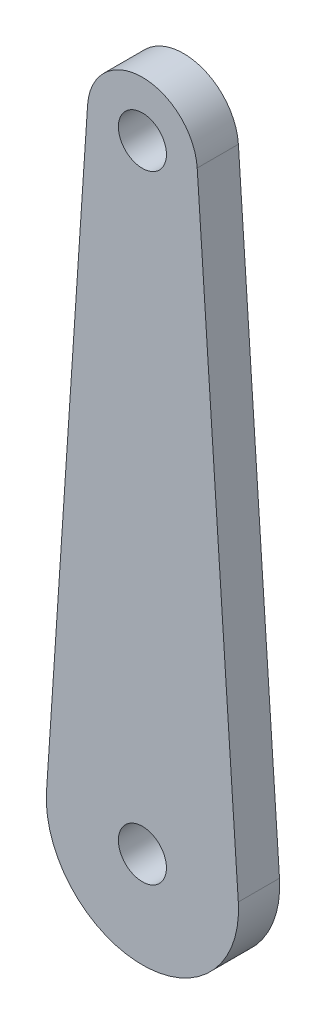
ISO-10303-21;
HEADER;
FILE_DESCRIPTION(('STEP AP214'),'2;1');
FILE_NAME('part.step','',(''),(''),'','','');
FILE_SCHEMA(('AUTOMOTIVE_DESIGN { 1 0 10303 214 1 1 1 1 }'));
ENDSEC;
DATA;
#1=APPLICATION_CONTEXT('core data for automotive mechanical design processes');
#2=APPLICATION_PROTOCOL_DEFINITION('international standard','automotive_design',2000,#1);
#3=PRODUCT_CONTEXT('',#1,'mechanical');
#4=PRODUCT('Part','Part','',(#3));
#5=PRODUCT_RELATED_PRODUCT_CATEGORY('part','',(#4));
#6=PRODUCT_DEFINITION_FORMATION('','',#4);
#7=PRODUCT_DEFINITION_CONTEXT('part definition',#1,'design');
#8=PRODUCT_DEFINITION('design','',#6,#7);
#9=PRODUCT_DEFINITION_SHAPE('','',#8);
#10=(LENGTH_UNIT() NAMED_UNIT(*) SI_UNIT(.MILLI.,.METRE.));
#11=(NAMED_UNIT(*) PLANE_ANGLE_UNIT() SI_UNIT($,.RADIAN.));
#12=(NAMED_UNIT(*) SI_UNIT($,.STERADIAN.) SOLID_ANGLE_UNIT());
#13=UNCERTAINTY_MEASURE_WITH_UNIT(LENGTH_MEASURE(1.E-05),#10,'distance_accuracy_value','');
#14=(GEOMETRIC_REPRESENTATION_CONTEXT(3) GLOBAL_UNCERTAINTY_ASSIGNED_CONTEXT((#13)) GLOBAL_UNIT_ASSIGNED_CONTEXT((#10,
#11,#12)) REPRESENTATION_CONTEXT('',''));
#15=CARTESIAN_POINT('',(0.,0.,0.));
#16=DIRECTION('',(0.,0.,1.));
#17=DIRECTION('',(1.,0.,0.));
#18=AXIS2_PLACEMENT_3D('',#15,#16,#17);
#19=CARTESIAN_POINT('',(0.,45.,3.));
#20=DIRECTION('',(0.,0.,1.));
#21=DIRECTION('',(1.,0.,0.));
#22=AXIS2_PLACEMENT_3D('',#19,#20,#21);
#23=PLANE('',#22);
#24=CARTESIAN_POINT('',(0.,0.,3.));
#25=DIRECTION('',(0.,0.,1.));
#26=DIRECTION('',(1.,0.,0.));
#27=AXIS2_PLACEMENT_3D('',#24,#25,#26);
#28=CIRCLE('',#27,1.75);
#29=CARTESIAN_POINT('',(1.75,0.,3.));
#30=VERTEX_POINT('',#29);
#31=EDGE_CURVE('E97',#30,#30,#28,.T.);
#32=ORIENTED_EDGE('',*,*,#31,.F.);
#33=EDGE_LOOP('',(#32));
#34=FACE_BOUND('',#33,.T.);
#35=CARTESIAN_POINT('',(0.,45.,3.));
#36=DIRECTION('',(0.,0.,1.));
#37=DIRECTION('',(1.,0.,0.));
#38=AXIS2_PLACEMENT_3D('',#35,#36,#37);
#39=CIRCLE('',#38,4.);
#40=CARTESIAN_POINT('',(3.99110121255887,45.2666666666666,3.));
#41=VERTEX_POINT('',#40);
#42=CARTESIAN_POINT('',(-3.99110121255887,45.2666666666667,3.));
#43=VERTEX_POINT('',#42);
#44=EDGE_CURVE('E82',#41,#43,#39,.T.);
#45=ORIENTED_EDGE('',*,*,#44,.T.);
#46=DIRECTION('',(-0.0666666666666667,-0.997775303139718,0.));
#47=VECTOR('',#46,1.);
#48=CARTESIAN_POINT('',(-3.99110121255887,45.2666666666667,3.));
#49=LINE('',#48,#47);
#50=CARTESIAN_POINT('',(-6.98442712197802,0.466666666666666,3.));
#51=VERTEX_POINT('',#50);
#52=EDGE_CURVE('E77',#43,#51,#49,.T.);
#53=ORIENTED_EDGE('',*,*,#52,.T.);
#54=CARTESIAN_POINT('',(0.,0.,3.));
#55=DIRECTION('',(0.,0.,1.));
#56=DIRECTION('',(1.,0.,0.));
#57=AXIS2_PLACEMENT_3D('',#54,#55,#56);
#58=CIRCLE('',#57,7.);
#59=CARTESIAN_POINT('',(6.98442712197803,0.466666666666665,3.));
#60=VERTEX_POINT('',#59);
#61=EDGE_CURVE('E80',#51,#60,#58,.T.);
#62=ORIENTED_EDGE('',*,*,#61,.T.);
#63=DIRECTION('',(-0.0666666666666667,0.997775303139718,0.));
#64=VECTOR('',#63,1.);
#65=CARTESIAN_POINT('',(3.99110121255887,45.2666666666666,3.));
#66=LINE('',#65,#64);
#67=EDGE_CURVE('E47',#60,#41,#66,.T.);
#68=ORIENTED_EDGE('',*,*,#67,.T.);
#69=EDGE_LOOP('',(#45,#53,#62,#68));
#70=FACE_BOUND('',#69,.T.);
#71=CARTESIAN_POINT('',(0.,45.,3.));
#72=DIRECTION('',(0.,0.,1.));
#73=DIRECTION('',(1.,0.,0.));
#74=AXIS2_PLACEMENT_3D('',#71,#72,#73);
#75=CIRCLE('',#74,1.75);
#76=CARTESIAN_POINT('',(1.75,45.,3.));
#77=VERTEX_POINT('',#76);
#78=EDGE_CURVE('E112',#77,#77,#75,.T.);
#79=ORIENTED_EDGE('',*,*,#78,.F.);
#80=EDGE_LOOP('',(#79));
#81=FACE_BOUND('',#80,.T.);
#82=ADVANCED_FACE('F30',(#34,#70,#81),#23,.T.);
#83=CARTESIAN_POINT('',(0.,45.,0.));
#84=DIRECTION('',(0.,0.,1.));
#85=DIRECTION('',(1.,0.,0.));
#86=AXIS2_PLACEMENT_3D('',#83,#84,#85);
#87=PLANE('',#86);
#88=CARTESIAN_POINT('',(0.,0.,0.));
#89=DIRECTION('',(0.,0.,1.));
#90=DIRECTION('',(1.,0.,0.));
#91=AXIS2_PLACEMENT_3D('',#88,#89,#90);
#92=CIRCLE('',#91,1.75);
#93=CARTESIAN_POINT('',(1.75,0.,0.));
#94=VERTEX_POINT('',#93);
#95=EDGE_CURVE('E109',#94,#94,#92,.T.);
#96=ORIENTED_EDGE('',*,*,#95,.T.);
#97=EDGE_LOOP('',(#96));
#98=FACE_BOUND('',#97,.T.);
#99=CARTESIAN_POINT('',(0.,45.,0.));
#100=DIRECTION('',(0.,0.,1.));
#101=DIRECTION('',(1.,0.,0.));
#102=AXIS2_PLACEMENT_3D('',#99,#100,#101);
#103=CIRCLE('',#102,4.);
#104=CARTESIAN_POINT('',(3.99110121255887,45.2666666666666,0.));
#105=VERTEX_POINT('',#104);
#106=CARTESIAN_POINT('',(-3.99110121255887,45.2666666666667,0.));
#107=VERTEX_POINT('',#106);
#108=EDGE_CURVE('E94',#105,#107,#103,.T.);
#109=ORIENTED_EDGE('',*,*,#108,.F.);
#110=DIRECTION('',(-0.0666666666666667,0.997775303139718,0.));
#111=VECTOR('',#110,1.);
#112=CARTESIAN_POINT('',(3.99110121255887,45.2666666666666,0.));
#113=LINE('',#112,#111);
#114=CARTESIAN_POINT('',(6.98442712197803,0.466666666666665,0.));
#115=VERTEX_POINT('',#114);
#116=EDGE_CURVE('E70',#115,#105,#113,.T.);
#117=ORIENTED_EDGE('',*,*,#116,.F.);
#118=CARTESIAN_POINT('',(0.,0.,0.));
#119=DIRECTION('',(0.,0.,1.));
#120=DIRECTION('',(1.,0.,0.));
#121=AXIS2_PLACEMENT_3D('',#118,#119,#120);
#122=CIRCLE('',#121,7.);
#123=CARTESIAN_POINT('',(-6.98442712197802,0.466666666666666,0.));
#124=VERTEX_POINT('',#123);
#125=EDGE_CURVE('E64',#124,#115,#122,.T.);
#126=ORIENTED_EDGE('',*,*,#125,.F.);
#127=DIRECTION('',(-0.0666666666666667,-0.997775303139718,0.));
#128=VECTOR('',#127,1.);
#129=CARTESIAN_POINT('',(-3.99110121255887,45.2666666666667,0.));
#130=LINE('',#129,#128);
#131=EDGE_CURVE('E86',#107,#124,#130,.T.);
#132=ORIENTED_EDGE('',*,*,#131,.F.);
#133=EDGE_LOOP('',(#109,#117,#126,#132));
#134=FACE_BOUND('',#133,.T.);
#135=CARTESIAN_POINT('',(0.,45.,0.));
#136=DIRECTION('',(0.,0.,1.));
#137=DIRECTION('',(1.,0.,0.));
#138=AXIS2_PLACEMENT_3D('',#135,#136,#137);
#139=CIRCLE('',#138,1.75);
#140=CARTESIAN_POINT('',(1.75,45.,0.));
#141=VERTEX_POINT('',#140);
#142=EDGE_CURVE('E115',#141,#141,#139,.T.);
#143=ORIENTED_EDGE('',*,*,#142,.T.);
#144=EDGE_LOOP('',(#143));
#145=FACE_BOUND('',#144,.T.);
#146=ADVANCED_FACE('F105',(#98,#134,#145),#87,.F.);
#147=CARTESIAN_POINT('',(0.,45.,3.));
#148=DIRECTION('',(0.,0.,-1.));
#149=DIRECTION('',(-1.,0.,0.));
#150=AXIS2_PLACEMENT_3D('',#147,#148,#149);
#151=CYLINDRICAL_SURFACE('',#150,4.);
#152=ORIENTED_EDGE('',*,*,#108,.T.);
#153=DIRECTION('',(0.,0.,-1.));
#154=VECTOR('',#153,1.);
#155=CARTESIAN_POINT('',(-3.99110121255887,45.2666666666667,3.));
#156=LINE('',#155,#154);
#157=EDGE_CURVE('E11',#43,#107,#156,.T.);
#158=ORIENTED_EDGE('',*,*,#157,.F.);
#159=ORIENTED_EDGE('',*,*,#44,.F.);
#160=DIRECTION('',(0.,0.,-1.));
#161=VECTOR('',#160,1.);
#162=CARTESIAN_POINT('',(3.99110121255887,45.2666666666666,3.));
#163=LINE('',#162,#161);
#164=EDGE_CURVE('E90',#41,#105,#163,.T.);
#165=ORIENTED_EDGE('',*,*,#164,.T.);
#166=EDGE_LOOP('',(#152,#158,#159,#165));
#167=FACE_BOUND('',#166,.T.);
#168=ADVANCED_FACE('F32',(#167),#151,.T.);
#169=CARTESIAN_POINT('',(-3.99110121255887,45.2666666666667,3.));
#170=DIRECTION('',(0.997775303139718,-0.0666666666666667,0.));
#171=DIRECTION('',(0.0666666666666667,0.997775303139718,0.));
#172=AXIS2_PLACEMENT_3D('',#169,#170,#171);
#173=PLANE('',#172);
#174=ORIENTED_EDGE('',*,*,#131,.T.);
#175=DIRECTION('',(0.,0.,-1.));
#176=VECTOR('',#175,1.);
#177=CARTESIAN_POINT('',(-6.98442712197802,0.466666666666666,3.));
#178=LINE('',#177,#176);
#179=EDGE_CURVE('E39',#51,#124,#178,.T.);
#180=ORIENTED_EDGE('',*,*,#179,.F.);
#181=ORIENTED_EDGE('',*,*,#52,.F.);
#182=ORIENTED_EDGE('',*,*,#157,.T.);
#183=EDGE_LOOP('',(#174,#180,#181,#182));
#184=FACE_BOUND('',#183,.T.);
#185=ADVANCED_FACE('F85',(#184),#173,.F.);
#186=CARTESIAN_POINT('',(0.,0.,3.));
#187=DIRECTION('',(0.,0.,-1.));
#188=DIRECTION('',(-1.,0.,0.));
#189=AXIS2_PLACEMENT_3D('',#186,#187,#188);
#190=CYLINDRICAL_SURFACE('',#189,7.);
#191=ORIENTED_EDGE('',*,*,#125,.T.);
#192=DIRECTION('',(0.,0.,-1.));
#193=VECTOR('',#192,1.);
#194=CARTESIAN_POINT('',(6.98442712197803,0.466666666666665,3.));
#195=LINE('',#194,#193);
#196=EDGE_CURVE('E87',#60,#115,#195,.T.);
#197=ORIENTED_EDGE('',*,*,#196,.F.);
#198=ORIENTED_EDGE('',*,*,#61,.F.);
#199=ORIENTED_EDGE('',*,*,#179,.T.);
#200=EDGE_LOOP('',(#191,#197,#198,#199));
#201=FACE_BOUND('',#200,.T.);
#202=ADVANCED_FACE('F88',(#201),#190,.T.);
#203=CARTESIAN_POINT('',(3.99110121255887,45.2666666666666,3.));
#204=DIRECTION('',(-0.997775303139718,-0.0666666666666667,0.));
#205=DIRECTION('',(0.0666666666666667,-0.997775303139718,0.));
#206=AXIS2_PLACEMENT_3D('',#203,#204,#205);
#207=PLANE('',#206);
#208=ORIENTED_EDGE('',*,*,#116,.T.);
#209=ORIENTED_EDGE('',*,*,#164,.F.);
#210=ORIENTED_EDGE('',*,*,#67,.F.);
#211=ORIENTED_EDGE('',*,*,#196,.T.);
#212=EDGE_LOOP('',(#208,#209,#210,#211));
#213=FACE_BOUND('',#212,.T.);
#214=ADVANCED_FACE('F102',(#213),#207,.F.);
#215=CARTESIAN_POINT('',(0.,0.,3.));
#216=DIRECTION('',(0.,0.,-1.));
#217=DIRECTION('',(-1.,0.,0.));
#218=AXIS2_PLACEMENT_3D('',#215,#216,#217);
#219=CYLINDRICAL_SURFACE('',#218,1.75);
#220=ORIENTED_EDGE('',*,*,#31,.T.);
#221=EDGE_LOOP('',(#220));
#222=FACE_BOUND('',#221,.T.);
#223=ORIENTED_EDGE('',*,*,#95,.F.);
#224=EDGE_LOOP('',(#223));
#225=FACE_BOUND('',#224,.T.);
#226=ADVANCED_FACE('F133',(#222,#225),#219,.F.);
#227=CARTESIAN_POINT('',(0.,45.,3.));
#228=DIRECTION('',(0.,0.,-1.));
#229=DIRECTION('',(-1.,0.,0.));
#230=AXIS2_PLACEMENT_3D('',#227,#228,#229);
#231=CYLINDRICAL_SURFACE('',#230,1.75);
#232=ORIENTED_EDGE('',*,*,#78,.T.);
#233=EDGE_LOOP('',(#232));
#234=FACE_BOUND('',#233,.T.);
#235=ORIENTED_EDGE('',*,*,#142,.F.);
#236=EDGE_LOOP('',(#235));
#237=FACE_BOUND('',#236,.T.);
#238=ADVANCED_FACE('F121',(#234,#237),#231,.F.);
#239=CLOSED_SHELL('',(#82,#146,#168,#185,#202,#214,#226,#238));
#240=MANIFOLD_SOLID_BREP('B2',#239);
#241=ADVANCED_BREP_SHAPE_REPRESENTATION('',(#18,#240),#14);
#242=SHAPE_DEFINITION_REPRESENTATION(#9,#241);
ENDSEC;
END-ISO-10303-21;
